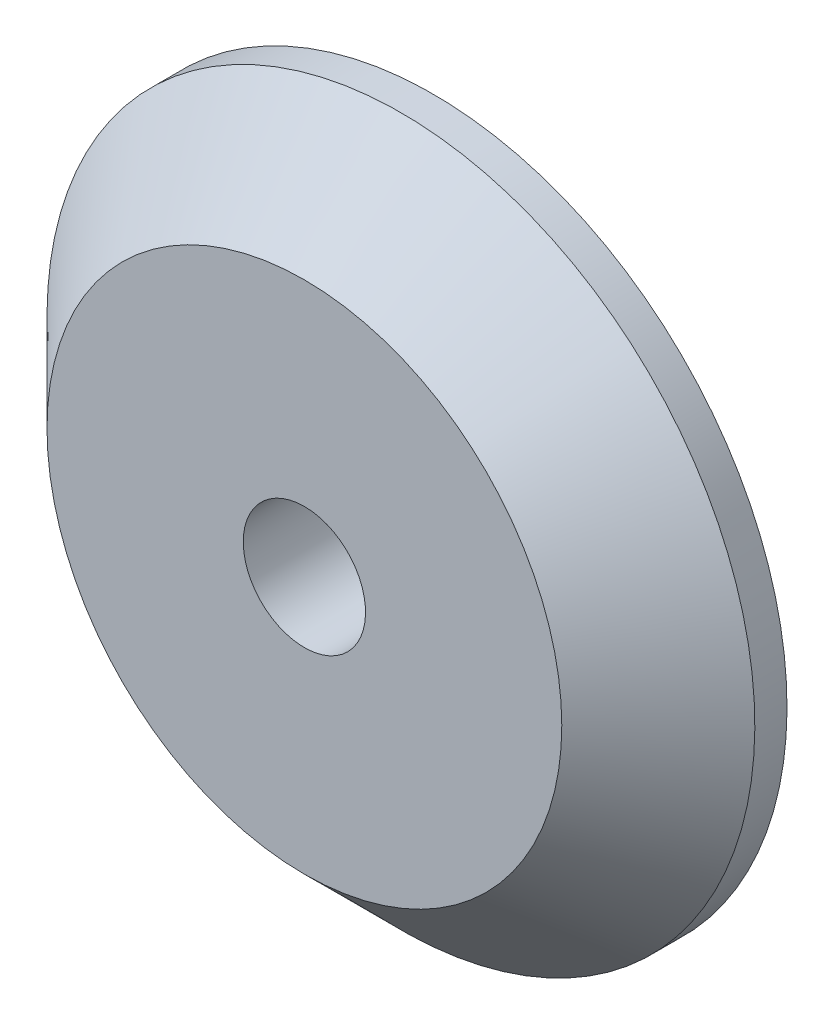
ISO-10303-21;
HEADER;
FILE_DESCRIPTION(('STEP AP214'),'2;1');
FILE_NAME('part.step','',(''),(''),'','','');
FILE_SCHEMA(('AUTOMOTIVE_DESIGN { 1 0 10303 214 1 1 1 1 }'));
ENDSEC;
DATA;
#1=APPLICATION_CONTEXT('core data for automotive mechanical design processes');
#2=APPLICATION_PROTOCOL_DEFINITION('international standard','automotive_design',2000,#1);
#3=PRODUCT_CONTEXT('',#1,'mechanical');
#4=PRODUCT('Part','Part','',(#3));
#5=PRODUCT_RELATED_PRODUCT_CATEGORY('part','',(#4));
#6=PRODUCT_DEFINITION_FORMATION('','',#4);
#7=PRODUCT_DEFINITION_CONTEXT('part definition',#1,'design');
#8=PRODUCT_DEFINITION('design','',#6,#7);
#9=PRODUCT_DEFINITION_SHAPE('','',#8);
#10=(LENGTH_UNIT() NAMED_UNIT(*) SI_UNIT(.MILLI.,.METRE.));
#11=(NAMED_UNIT(*) PLANE_ANGLE_UNIT() SI_UNIT($,.RADIAN.));
#12=(NAMED_UNIT(*) SI_UNIT($,.STERADIAN.) SOLID_ANGLE_UNIT());
#13=UNCERTAINTY_MEASURE_WITH_UNIT(LENGTH_MEASURE(1.E-05),#10,'distance_accuracy_value','');
#14=(GEOMETRIC_REPRESENTATION_CONTEXT(3) GLOBAL_UNCERTAINTY_ASSIGNED_CONTEXT((#13)) GLOBAL_UNIT_ASSIGNED_CONTEXT((#10,
#11,#12)) REPRESENTATION_CONTEXT('',''));
#15=CARTESIAN_POINT('',(0.,0.,0.));
#16=DIRECTION('',(0.,0.,1.));
#17=DIRECTION('',(1.,0.,0.));
#18=AXIS2_PLACEMENT_3D('',#15,#16,#17);
#19=CARTESIAN_POINT('',(-14.925,44.775,0.));
#20=DIRECTION('',(0.,0.,-1.));
#21=DIRECTION('',(-0.923728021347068,-0.383049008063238,0.));
#22=AXIS2_PLACEMENT_3D('',#19,#20,#21);
#23=PLANE('',#22);
#24=CARTESIAN_POINT('',(-14.925,44.775,0.));
#25=DIRECTION('',(0.,0.,-1.));
#26=DIRECTION('',(-0.923728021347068,-0.383049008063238,0.));
#27=AXIS2_PLACEMENT_3D('',#24,#25,#26);
#28=CIRCLE('',#27,5.4998625);
#29=CARTESIAN_POINT('',(-20.0053771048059,42.6682831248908,0.));
#30=VERTEX_POINT('',#29);
#31=EDGE_CURVE('E36',#30,#30,#28,.T.);
#32=ORIENTED_EDGE('',*,*,#31,.T.);
#33=EDGE_LOOP('',(#32));
#34=FACE_BOUND('',#33,.T.);
#35=CARTESIAN_POINT('',(-14.925,44.775,0.));
#36=DIRECTION('',(0.,0.,-1.));
#37=DIRECTION('',(-0.923728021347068,-0.383049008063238,0.));
#38=AXIS2_PLACEMENT_3D('',#35,#36,#37);
#39=CIRCLE('',#38,0.94997625);
#40=CARTESIAN_POINT('',(-15.8025196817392,44.4111125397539,0.));
#41=VERTEX_POINT('',#40);
#42=EDGE_CURVE('E49',#41,#41,#39,.T.);
#43=ORIENTED_EDGE('',*,*,#42,.F.);
#44=EDGE_LOOP('',(#43));
#45=FACE_BOUND('',#44,.T.);
#46=ADVANCED_FACE('F14',(#34,#45),#23,.T.);
#47=CARTESIAN_POINT('',(-14.925,44.775,1.99995));
#48=DIRECTION('',(0.,0.,-1.));
#49=DIRECTION('',(-0.923728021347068,-0.383049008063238,0.));
#50=AXIS2_PLACEMENT_3D('',#47,#48,#49);
#51=PLANE('',#50);
#52=CARTESIAN_POINT('',(-14.925,44.775,1.99995));
#53=DIRECTION('',(0.,0.,-1.));
#54=DIRECTION('',(-0.923728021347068,-0.383049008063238,0.));
#55=AXIS2_PLACEMENT_3D('',#52,#53,#54);
#56=CIRCLE('',#55,3.9999);
#57=CARTESIAN_POINT('',(-18.6198197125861,43.2428422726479,1.99995));
#58=VERTEX_POINT('',#57);
#59=EDGE_CURVE('E10',#58,#58,#56,.F.);
#60=ORIENTED_EDGE('',*,*,#59,.T.);
#61=EDGE_LOOP('',(#60));
#62=FACE_BOUND('',#61,.T.);
#63=CARTESIAN_POINT('',(-14.925,44.775,1.99995));
#64=DIRECTION('',(0.,0.,-1.));
#65=DIRECTION('',(-0.923728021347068,-0.383049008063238,0.));
#66=AXIS2_PLACEMENT_3D('',#63,#64,#65);
#67=CIRCLE('',#66,0.94997625);
#68=CARTESIAN_POINT('',(-15.8025196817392,44.4111125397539,1.99995));
#69=VERTEX_POINT('',#68);
#70=EDGE_CURVE('E55',#69,#69,#67,.T.);
#71=ORIENTED_EDGE('',*,*,#70,.T.);
#72=EDGE_LOOP('',(#71));
#73=FACE_BOUND('',#72,.T.);
#74=ADVANCED_FACE('F69',(#62,#73),#51,.F.);
#75=CARTESIAN_POINT('',(-14.925,44.775,0.));
#76=DIRECTION('',(0.,0.,1.));
#77=DIRECTION('',(0.923728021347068,0.383049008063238,0.));
#78=AXIS2_PLACEMENT_3D('',#75,#76,#77);
#79=CYLINDRICAL_SURFACE('',#78,5.4998625);
#80=CARTESIAN_POINT('',(-14.925,44.775,0.4999875));
#81=DIRECTION('',(0.,0.,-1.));
#82=DIRECTION('',(-0.923728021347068,-0.383049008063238,0.));
#83=AXIS2_PLACEMENT_3D('',#80,#81,#82);
#84=CIRCLE('',#83,5.4998625);
#85=CARTESIAN_POINT('',(-20.0053771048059,42.6682831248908,0.4999875));
#86=VERTEX_POINT('',#85);
#87=EDGE_CURVE('E22',#86,#86,#84,.T.);
#88=ORIENTED_EDGE('',*,*,#87,.T.);
#89=EDGE_LOOP('',(#88));
#90=FACE_BOUND('',#89,.T.);
#91=ORIENTED_EDGE('',*,*,#31,.F.);
#92=EDGE_LOOP('',(#91));
#93=FACE_BOUND('',#92,.T.);
#94=ADVANCED_FACE('F16',(#90,#93),#79,.T.);
#95=CARTESIAN_POINT('',(-14.925,44.775,0.));
#96=DIRECTION('',(0.,0.,1.));
#97=DIRECTION('',(0.923728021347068,0.383049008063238,0.));
#98=AXIS2_PLACEMENT_3D('',#95,#96,#97);
#99=CYLINDRICAL_SURFACE('',#98,0.94997625);
#100=ORIENTED_EDGE('',*,*,#42,.T.);
#101=EDGE_LOOP('',(#100));
#102=FACE_BOUND('',#101,.T.);
#103=ORIENTED_EDGE('',*,*,#70,.F.);
#104=EDGE_LOOP('',(#103));
#105=FACE_BOUND('',#104,.T.);
#106=ADVANCED_FACE('F71',(#102,#105),#99,.F.);
#107=CARTESIAN_POINT('',(-14.925,44.775,0.4999875));
#108=DIRECTION('',(0.,0.,-1.));
#109=DIRECTION('',(-0.923728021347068,-0.383049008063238,0.));
#110=AXIS2_PLACEMENT_3D('',#107,#108,#109);
#111=CONICAL_SURFACE('',#110,5.4998625,0.785398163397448);
#112=ORIENTED_EDGE('',*,*,#59,.F.);
#113=EDGE_LOOP('',(#112));
#114=FACE_BOUND('',#113,.T.);
#115=ORIENTED_EDGE('',*,*,#87,.F.);
#116=EDGE_LOOP('',(#115));
#117=FACE_BOUND('',#116,.T.);
#118=ADVANCED_FACE('F73',(#114,#117),#111,.T.);
#119=CLOSED_SHELL('',(#46,#74,#94,#106,#118));
#120=MANIFOLD_SOLID_BREP('B1',#119);
#121=ADVANCED_BREP_SHAPE_REPRESENTATION('',(#18,#120),#14);
#122=SHAPE_DEFINITION_REPRESENTATION(#9,#121);
ENDSEC;
END-ISO-10303-21;
